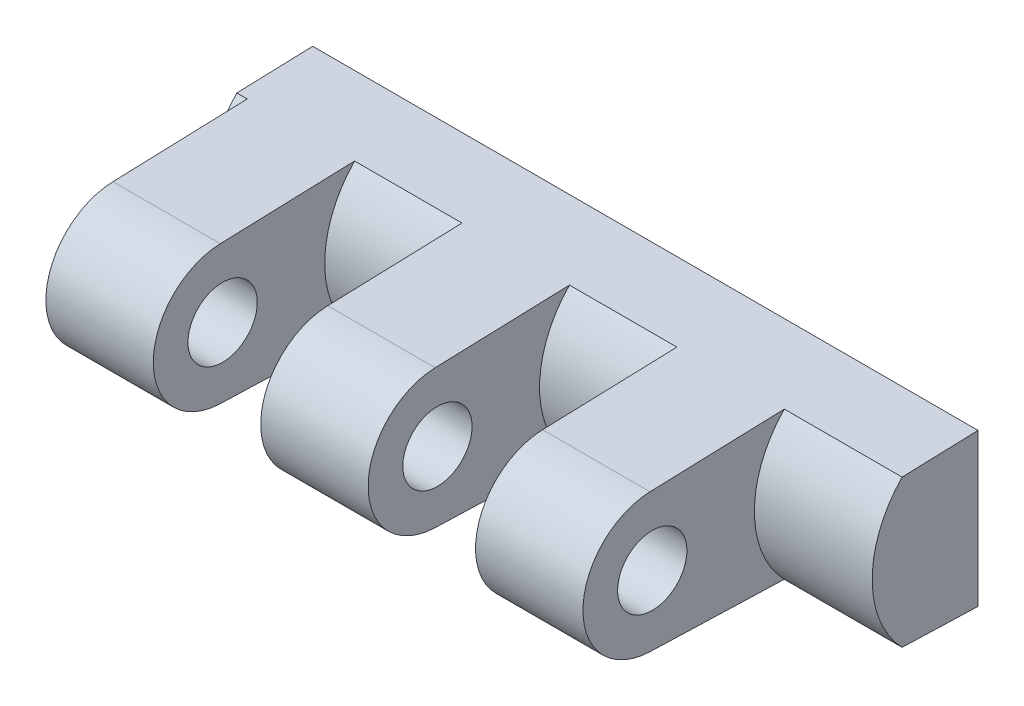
ISO-10303-21;
HEADER;
FILE_DESCRIPTION(('STEP AP214'),'2;1');
FILE_NAME('part.step','',(''),(''),'','','');
FILE_SCHEMA(('AUTOMOTIVE_DESIGN { 1 0 10303 214 1 1 1 1 }'));
ENDSEC;
DATA;
#1=APPLICATION_CONTEXT('core data for automotive mechanical design processes');
#2=APPLICATION_PROTOCOL_DEFINITION('international standard','automotive_design',2000,#1);
#3=PRODUCT_CONTEXT('',#1,'mechanical');
#4=PRODUCT('Part','Part','',(#3));
#5=PRODUCT_RELATED_PRODUCT_CATEGORY('part','',(#4));
#6=PRODUCT_DEFINITION_FORMATION('','',#4);
#7=PRODUCT_DEFINITION_CONTEXT('part definition',#1,'design');
#8=PRODUCT_DEFINITION('design','',#6,#7);
#9=PRODUCT_DEFINITION_SHAPE('','',#8);
#10=(LENGTH_UNIT() NAMED_UNIT(*) SI_UNIT(.MILLI.,.METRE.));
#11=(NAMED_UNIT(*) PLANE_ANGLE_UNIT() SI_UNIT($,.RADIAN.));
#12=(NAMED_UNIT(*) SI_UNIT($,.STERADIAN.) SOLID_ANGLE_UNIT());
#13=UNCERTAINTY_MEASURE_WITH_UNIT(LENGTH_MEASURE(1.E-05),#10,'distance_accuracy_value','');
#14=(GEOMETRIC_REPRESENTATION_CONTEXT(3) GLOBAL_UNCERTAINTY_ASSIGNED_CONTEXT((#13)) GLOBAL_UNIT_ASSIGNED_CONTEXT((#10,
#11,#12)) REPRESENTATION_CONTEXT('',''));
#15=CARTESIAN_POINT('',(0.,0.,0.));
#16=DIRECTION('',(0.,0.,1.));
#17=DIRECTION('',(1.,0.,0.));
#18=AXIS2_PLACEMENT_3D('',#15,#16,#17);
#19=CARTESIAN_POINT('',(36.25,-5.5,0.));
#20=DIRECTION('',(0.,-0.999450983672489,0.0331320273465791));
#21=DIRECTION('',(0.,0.0331320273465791,0.999450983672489));
#22=AXIS2_PLACEMENT_3D('',#19,#20,#21);
#23=PLANE('',#22);
#24=DIRECTION('',(-1.,0.,0.));
#25=VECTOR('',#24,1.);
#26=CARTESIAN_POINT('',(-11.755,-5.31847257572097,5.47590284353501));
#27=LINE('',#26,#25);
#28=CARTESIAN_POINT('',(-11.25,-5.31847257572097,5.47590284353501));
#29=VERTEX_POINT('',#28);
#30=CARTESIAN_POINT('',(-12.,-5.31847257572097,5.47590284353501));
#31=VERTEX_POINT('',#30);
#32=EDGE_CURVE('E135',#29,#31,#27,.T.);
#33=ORIENTED_EDGE('',*,*,#32,.T.);
#34=DIRECTION('',(0.,0.0331320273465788,0.999450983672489));
#35=VECTOR('',#34,1.);
#36=CARTESIAN_POINT('',(-12.,-5.5,0.));
#37=LINE('',#36,#35);
#38=CARTESIAN_POINT('',(-12.,-5.5,0.));
#39=VERTEX_POINT('',#38);
#40=EDGE_CURVE('E30',#39,#31,#37,.T.);
#41=ORIENTED_EDGE('',*,*,#40,.F.);
#42=DIRECTION('',(-1.,0.,0.));
#43=VECTOR('',#42,1.);
#44=CARTESIAN_POINT('',(36.25,-5.5,0.));
#45=LINE('',#44,#43);
#46=CARTESIAN_POINT('',(36.,-5.5,0.));
#47=VERTEX_POINT('',#46);
#48=EDGE_CURVE('E18',#39,#47,#45,.F.);
#49=ORIENTED_EDGE('',*,*,#48,.T.);
#50=DIRECTION('',(0.,-0.0331320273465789,-0.999450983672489));
#51=VECTOR('',#50,1.);
#52=CARTESIAN_POINT('',(36.,-5.31847257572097,5.47590284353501));
#53=LINE('',#52,#51);
#54=CARTESIAN_POINT('',(36.,-5.31847257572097,5.47590284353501));
#55=VERTEX_POINT('',#54);
#56=EDGE_CURVE('E281',#55,#47,#53,.T.);
#57=ORIENTED_EDGE('',*,*,#56,.F.);
#58=DIRECTION('',(1.,0.,0.));
#59=VECTOR('',#58,1.);
#60=CARTESIAN_POINT('',(36.25,-5.31847257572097,5.47590284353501));
#61=LINE('',#60,#59);
#62=CARTESIAN_POINT('',(27.5,-5.31847257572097,5.47590284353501));
#63=VERTEX_POINT('',#62);
#64=EDGE_CURVE('E181',#63,#55,#61,.T.);
#65=ORIENTED_EDGE('',*,*,#64,.F.);
#66=DIRECTION('',(0.,0.0331320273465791,0.999450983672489));
#67=VECTOR('',#66,1.);
#68=CARTESIAN_POINT('',(27.5,-5.5,0.));
#69=LINE('',#68,#67);
#70=CARTESIAN_POINT('',(27.5,-4.99725491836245,15.1656601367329));
#71=VERTEX_POINT('',#70);
#72=EDGE_CURVE('E189',#71,#63,#69,.F.);
#73=ORIENTED_EDGE('',*,*,#72,.F.);
#74=DIRECTION('',(1.,0.,0.));
#75=VECTOR('',#74,1.);
#76=CARTESIAN_POINT('',(36.25,-4.99725491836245,15.1656601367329));
#77=LINE('',#76,#75);
#78=CARTESIAN_POINT('',(19.75,-4.99725491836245,15.1656601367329));
#79=VERTEX_POINT('',#78);
#80=EDGE_CURVE('E187',#79,#71,#77,.T.);
#81=ORIENTED_EDGE('',*,*,#80,.F.);
#82=DIRECTION('',(0.,0.0331320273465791,0.999450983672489));
#83=VECTOR('',#82,1.);
#84=CARTESIAN_POINT('',(19.75,-5.5,0.));
#85=LINE('',#84,#83);
#86=CARTESIAN_POINT('',(19.75,-5.31847257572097,5.47590284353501));
#87=VERTEX_POINT('',#86);
#88=EDGE_CURVE('E190',#87,#79,#85,.T.);
#89=ORIENTED_EDGE('',*,*,#88,.F.);
#90=DIRECTION('',(1.,0.,0.));
#91=VECTOR('',#90,1.);
#92=CARTESIAN_POINT('',(36.25,-5.31847257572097,5.47590284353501));
#93=LINE('',#92,#91);
#94=CARTESIAN_POINT('',(12.,-5.31847257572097,5.47590284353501));
#95=VERTEX_POINT('',#94);
#96=EDGE_CURVE('E193',#95,#87,#93,.T.);
#97=ORIENTED_EDGE('',*,*,#96,.F.);
#98=DIRECTION('',(0.,0.0331320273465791,0.999450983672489));
#99=VECTOR('',#98,1.);
#100=CARTESIAN_POINT('',(12.,-5.5,0.));
#101=LINE('',#100,#99);
#102=CARTESIAN_POINT('',(12.,-4.99725491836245,15.1656601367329));
#103=VERTEX_POINT('',#102);
#104=EDGE_CURVE('E195',#103,#95,#101,.F.);
#105=ORIENTED_EDGE('',*,*,#104,.F.);
#106=DIRECTION('',(1.,0.,0.));
#107=VECTOR('',#106,1.);
#108=CARTESIAN_POINT('',(36.25,-4.99725491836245,15.1656601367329));
#109=LINE('',#108,#107);
#110=CARTESIAN_POINT('',(4.25,-4.99725491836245,15.1656601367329));
#111=VERTEX_POINT('',#110);
#112=EDGE_CURVE('E197',#111,#103,#109,.T.);
#113=ORIENTED_EDGE('',*,*,#112,.F.);
#114=DIRECTION('',(0.,0.0331320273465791,0.999450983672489));
#115=VECTOR('',#114,1.);
#116=CARTESIAN_POINT('',(4.25,-5.5,0.));
#117=LINE('',#116,#115);
#118=CARTESIAN_POINT('',(4.25,-5.31847257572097,5.47590284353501));
#119=VERTEX_POINT('',#118);
#120=EDGE_CURVE('E199',#119,#111,#117,.T.);
#121=ORIENTED_EDGE('',*,*,#120,.F.);
#122=DIRECTION('',(1.,0.,0.));
#123=VECTOR('',#122,1.);
#124=CARTESIAN_POINT('',(36.25,-5.31847257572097,5.47590284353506));
#125=LINE('',#124,#123);
#126=CARTESIAN_POINT('',(-3.5,-5.31847257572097,5.47590284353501));
#127=VERTEX_POINT('',#126);
#128=EDGE_CURVE('E201',#127,#119,#125,.T.);
#129=ORIENTED_EDGE('',*,*,#128,.F.);
#130=DIRECTION('',(0.,0.0331320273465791,0.999450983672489));
#131=VECTOR('',#130,1.);
#132=CARTESIAN_POINT('',(-3.5,-5.5,0.));
#133=LINE('',#132,#131);
#134=CARTESIAN_POINT('',(-3.5,-4.99725491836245,15.1656601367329));
#135=VERTEX_POINT('',#134);
#136=EDGE_CURVE('E203',#135,#127,#133,.F.);
#137=ORIENTED_EDGE('',*,*,#136,.F.);
#138=DIRECTION('',(1.,0.,0.));
#139=VECTOR('',#138,1.);
#140=CARTESIAN_POINT('',(36.25,-4.99725491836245,15.1656601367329));
#141=LINE('',#140,#139);
#142=CARTESIAN_POINT('',(-11.25,-4.99725491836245,15.1656601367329));
#143=VERTEX_POINT('',#142);
#144=EDGE_CURVE('E205',#143,#135,#141,.T.);
#145=ORIENTED_EDGE('',*,*,#144,.F.);
#146=DIRECTION('',(0.,0.0331320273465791,0.999450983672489));
#147=VECTOR('',#146,1.);
#148=CARTESIAN_POINT('',(-11.25,-5.5,0.));
#149=LINE('',#148,#147);
#150=EDGE_CURVE('E183',#29,#143,#149,.T.);
#151=ORIENTED_EDGE('',*,*,#150,.F.);
#152=EDGE_LOOP('',(#33,#41,#49,#57,#65,#73,#81,#89,#97,#105,#113,#121,#129,#137,#145,#151));
#153=FACE_BOUND('',#152,.T.);
#154=ADVANCED_FACE('F14',(#153),#23,.T.);
#155=CARTESIAN_POINT('',(36.25,4.99725491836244,15.1656601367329));
#156=DIRECTION('',(0.,0.999450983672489,0.0331320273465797));
#157=DIRECTION('',(0.,0.0331320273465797,-0.999450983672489));
#158=AXIS2_PLACEMENT_3D('',#155,#156,#157);
#159=PLANE('',#158);
#160=DIRECTION('',(-1.,0.,0.));
#161=VECTOR('',#160,1.);
#162=CARTESIAN_POINT('',(36.25,5.5,0.));
#163=LINE('',#162,#161);
#164=CARTESIAN_POINT('',(36.,5.5,0.));
#165=VERTEX_POINT('',#164);
#166=CARTESIAN_POINT('',(-12.,5.5,0.));
#167=VERTEX_POINT('',#166);
#168=EDGE_CURVE('E9',#165,#167,#163,.T.);
#169=ORIENTED_EDGE('',*,*,#168,.T.);
#170=DIRECTION('',(0.,0.0331320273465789,-0.999450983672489));
#171=VECTOR('',#170,1.);
#172=CARTESIAN_POINT('',(-12.,5.31847257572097,5.47590284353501));
#173=LINE('',#172,#171);
#174=CARTESIAN_POINT('',(-12.,5.31847257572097,5.47590284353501));
#175=VERTEX_POINT('',#174);
#176=EDGE_CURVE('E129',#175,#167,#173,.T.);
#177=ORIENTED_EDGE('',*,*,#176,.F.);
#178=DIRECTION('',(-1.,0.,0.));
#179=VECTOR('',#178,1.);
#180=CARTESIAN_POINT('',(-11.755,5.31847257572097,5.47590284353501));
#181=LINE('',#180,#179);
#182=CARTESIAN_POINT('',(-11.25,5.31847257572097,5.47590284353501));
#183=VERTEX_POINT('',#182);
#184=EDGE_CURVE('E210',#175,#183,#181,.F.);
#185=ORIENTED_EDGE('',*,*,#184,.T.);
#186=DIRECTION('',(0.,0.0331320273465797,-0.999450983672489));
#187=VECTOR('',#186,1.);
#188=CARTESIAN_POINT('',(-11.25,4.99725491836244,15.1656601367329));
#189=LINE('',#188,#187);
#190=CARTESIAN_POINT('',(-11.25,4.99725491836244,15.1656601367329));
#191=VERTEX_POINT('',#190);
#192=EDGE_CURVE('E141',#191,#183,#189,.T.);
#193=ORIENTED_EDGE('',*,*,#192,.F.);
#194=DIRECTION('',(1.,0.,0.));
#195=VECTOR('',#194,1.);
#196=CARTESIAN_POINT('',(36.25,4.99725491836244,15.1656601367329));
#197=LINE('',#196,#195);
#198=CARTESIAN_POINT('',(-3.5,4.99725491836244,15.1656601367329));
#199=VERTEX_POINT('',#198);
#200=EDGE_CURVE('E143',#199,#191,#197,.F.);
#201=ORIENTED_EDGE('',*,*,#200,.F.);
#202=DIRECTION('',(0.,0.0331320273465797,-0.999450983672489));
#203=VECTOR('',#202,1.);
#204=CARTESIAN_POINT('',(-3.5,4.99725491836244,15.1656601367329));
#205=LINE('',#204,#203);
#206=CARTESIAN_POINT('',(-3.5,5.31847257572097,5.47590284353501));
#207=VERTEX_POINT('',#206);
#208=EDGE_CURVE('E150',#207,#199,#205,.F.);
#209=ORIENTED_EDGE('',*,*,#208,.F.);
#210=DIRECTION('',(1.,0.,0.));
#211=VECTOR('',#210,1.);
#212=CARTESIAN_POINT('',(36.25,5.31847257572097,5.47590284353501));
#213=LINE('',#212,#211);
#214=CARTESIAN_POINT('',(4.25,5.31847257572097,5.47590284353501));
#215=VERTEX_POINT('',#214);
#216=EDGE_CURVE('E156',#215,#207,#213,.F.);
#217=ORIENTED_EDGE('',*,*,#216,.F.);
#218=DIRECTION('',(0.,0.0331320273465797,-0.999450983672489));
#219=VECTOR('',#218,1.);
#220=CARTESIAN_POINT('',(4.25,4.99725491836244,15.1656601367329));
#221=LINE('',#220,#219);
#222=CARTESIAN_POINT('',(4.25,4.99725491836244,15.1656601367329));
#223=VERTEX_POINT('',#222);
#224=EDGE_CURVE('E159',#223,#215,#221,.T.);
#225=ORIENTED_EDGE('',*,*,#224,.F.);
#226=DIRECTION('',(1.,0.,0.));
#227=VECTOR('',#226,1.);
#228=CARTESIAN_POINT('',(36.25,4.99725491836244,15.1656601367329));
#229=LINE('',#228,#227);
#230=CARTESIAN_POINT('',(12.,4.99725491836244,15.1656601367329));
#231=VERTEX_POINT('',#230);
#232=EDGE_CURVE('E162',#231,#223,#229,.F.);
#233=ORIENTED_EDGE('',*,*,#232,.F.);
#234=DIRECTION('',(0.,0.0331320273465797,-0.999450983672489));
#235=VECTOR('',#234,1.);
#236=CARTESIAN_POINT('',(12.,4.99725491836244,15.1656601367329));
#237=LINE('',#236,#235);
#238=CARTESIAN_POINT('',(12.,5.31847257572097,5.47590284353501));
#239=VERTEX_POINT('',#238);
#240=EDGE_CURVE('E165',#239,#231,#237,.F.);
#241=ORIENTED_EDGE('',*,*,#240,.F.);
#242=DIRECTION('',(1.,0.,0.));
#243=VECTOR('',#242,1.);
#244=CARTESIAN_POINT('',(36.25,5.31847257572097,5.47590284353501));
#245=LINE('',#244,#243);
#246=CARTESIAN_POINT('',(19.75,5.31847257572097,5.47590284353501));
#247=VERTEX_POINT('',#246);
#248=EDGE_CURVE('E168',#247,#239,#245,.F.);
#249=ORIENTED_EDGE('',*,*,#248,.F.);
#250=DIRECTION('',(0.,0.0331320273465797,-0.999450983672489));
#251=VECTOR('',#250,1.);
#252=CARTESIAN_POINT('',(19.75,4.99725491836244,15.1656601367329));
#253=LINE('',#252,#251);
#254=CARTESIAN_POINT('',(19.75,4.99725491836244,15.1656601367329));
#255=VERTEX_POINT('',#254);
#256=EDGE_CURVE('E171',#255,#247,#253,.T.);
#257=ORIENTED_EDGE('',*,*,#256,.F.);
#258=DIRECTION('',(1.,0.,0.));
#259=VECTOR('',#258,1.);
#260=CARTESIAN_POINT('',(36.25,4.99725491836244,15.1656601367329));
#261=LINE('',#260,#259);
#262=CARTESIAN_POINT('',(27.5,4.99725491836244,15.1656601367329));
#263=VERTEX_POINT('',#262);
#264=EDGE_CURVE('E174',#263,#255,#261,.F.);
#265=ORIENTED_EDGE('',*,*,#264,.F.);
#266=DIRECTION('',(0.,0.0331320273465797,-0.999450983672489));
#267=VECTOR('',#266,1.);
#268=CARTESIAN_POINT('',(27.5,4.99725491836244,15.1656601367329));
#269=LINE('',#268,#267);
#270=CARTESIAN_POINT('',(27.5,5.31847257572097,5.47590284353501));
#271=VERTEX_POINT('',#270);
#272=EDGE_CURVE('E177',#271,#263,#269,.F.);
#273=ORIENTED_EDGE('',*,*,#272,.F.);
#274=DIRECTION('',(1.,0.,0.));
#275=VECTOR('',#274,1.);
#276=CARTESIAN_POINT('',(36.25,5.31847257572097,5.47590284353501));
#277=LINE('',#276,#275);
#278=CARTESIAN_POINT('',(36.,5.31847257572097,5.47590284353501));
#279=VERTEX_POINT('',#278);
#280=EDGE_CURVE('E180',#279,#271,#277,.F.);
#281=ORIENTED_EDGE('',*,*,#280,.F.);
#282=DIRECTION('',(0.,-0.0331320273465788,0.999450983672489));
#283=VECTOR('',#282,1.);
#284=CARTESIAN_POINT('',(36.,5.5,0.));
#285=LINE('',#284,#283);
#286=EDGE_CURVE('E278',#165,#279,#285,.T.);
#287=ORIENTED_EDGE('',*,*,#286,.F.);
#288=EDGE_LOOP('',(#169,#177,#185,#193,#201,#209,#217,#225,#233,#241,#249,#257,#265,#273,#281,#287));
#289=FACE_BOUND('',#288,.T.);
#290=ADVANCED_FACE('F287',(#289),#159,.T.);
#291=CARTESIAN_POINT('',(36.25,5.5,0.));
#292=DIRECTION('',(0.,0.,-1.));
#293=DIRECTION('',(-1.,0.,0.));
#294=AXIS2_PLACEMENT_3D('',#291,#292,#293);
#295=PLANE('',#294);
#296=CARTESIAN_POINT('',(24.,0.,0.));
#297=DIRECTION('',(0.,0.,1.));
#298=DIRECTION('',(-1.,0.,0.));
#299=AXIS2_PLACEMENT_3D('',#296,#297,#298);
#300=CIRCLE('',#299,2.5);
#301=CARTESIAN_POINT('',(21.5,0.,0.));
#302=VERTEX_POINT('',#301);
#303=EDGE_CURVE('E265',#302,#302,#300,.T.);
#304=ORIENTED_EDGE('',*,*,#303,.T.);
#305=EDGE_LOOP('',(#304));
#306=FACE_BOUND('',#305,.T.);
#307=CARTESIAN_POINT('',(0.,0.,0.));
#308=DIRECTION('',(0.,0.,1.));
#309=DIRECTION('',(-1.,0.,0.));
#310=AXIS2_PLACEMENT_3D('',#307,#308,#309);
#311=CIRCLE('',#310,2.5);
#312=CARTESIAN_POINT('',(-2.5,0.,0.));
#313=VERTEX_POINT('',#312);
#314=EDGE_CURVE('E271',#313,#313,#311,.T.);
#315=ORIENTED_EDGE('',*,*,#314,.T.);
#316=EDGE_LOOP('',(#315));
#317=FACE_BOUND('',#316,.T.);
#318=ORIENTED_EDGE('',*,*,#48,.F.);
#319=DIRECTION('',(0.,-1.,0.));
#320=VECTOR('',#319,1.);
#321=CARTESIAN_POINT('',(-12.,5.5,0.));
#322=LINE('',#321,#320);
#323=EDGE_CURVE('E126',#167,#39,#322,.T.);
#324=ORIENTED_EDGE('',*,*,#323,.F.);
#325=ORIENTED_EDGE('',*,*,#168,.F.);
#326=DIRECTION('',(0.,1.,0.));
#327=VECTOR('',#326,1.);
#328=CARTESIAN_POINT('',(36.,-5.5,0.));
#329=LINE('',#328,#327);
#330=EDGE_CURVE('E140',#47,#165,#329,.T.);
#331=ORIENTED_EDGE('',*,*,#330,.F.);
#332=EDGE_LOOP('',(#318,#324,#325,#331));
#333=FACE_BOUND('',#332,.T.);
#334=ADVANCED_FACE('F139',(#306,#317,#333),#295,.T.);
#335=CARTESIAN_POINT('',(-11.755,0.,0.));
#336=DIRECTION('',(-1.,0.,0.));
#337=DIRECTION('',(0.,1.,0.));
#338=AXIS2_PLACEMENT_3D('',#335,#336,#337);
#339=CYLINDRICAL_SURFACE('',#338,7.63358778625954);
#340=ORIENTED_EDGE('',*,*,#184,.F.);
#341=CARTESIAN_POINT('',(-12.,0.,0.));
#342=DIRECTION('',(-1.,0.,0.));
#343=DIRECTION('',(0.,0.,1.));
#344=AXIS2_PLACEMENT_3D('',#341,#342,#343);
#345=CIRCLE('',#344,7.63358778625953);
#346=EDGE_CURVE('E136',#31,#175,#345,.T.);
#347=ORIENTED_EDGE('',*,*,#346,.F.);
#348=ORIENTED_EDGE('',*,*,#32,.F.);
#349=CARTESIAN_POINT('',(-11.25,0.,0.));
#350=DIRECTION('',(1.,0.,0.));
#351=DIRECTION('',(0.,1.,0.));
#352=AXIS2_PLACEMENT_3D('',#349,#350,#351);
#353=CIRCLE('',#352,7.63358778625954);
#354=EDGE_CURVE('E214',#183,#29,#353,.T.);
#355=ORIENTED_EDGE('',*,*,#354,.F.);
#356=EDGE_LOOP('',(#340,#347,#348,#355));
#357=FACE_BOUND('',#356,.T.);
#358=ADVANCED_FACE('F289',(#357),#339,.T.);
#359=CARTESIAN_POINT('',(31.88,0.,0.));
#360=DIRECTION('',(-1.,0.,0.));
#361=DIRECTION('',(0.,1.,0.));
#362=AXIS2_PLACEMENT_3D('',#359,#360,#361);
#363=CYLINDRICAL_SURFACE('',#362,7.63358778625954);
#364=ORIENTED_EDGE('',*,*,#64,.T.);
#365=CARTESIAN_POINT('',(36.,0.,0.));
#366=DIRECTION('',(1.,0.,0.));
#367=DIRECTION('',(0.,0.,-1.));
#368=AXIS2_PLACEMENT_3D('',#365,#366,#367);
#369=CIRCLE('',#368,7.63358778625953);
#370=EDGE_CURVE('E274',#279,#55,#369,.T.);
#371=ORIENTED_EDGE('',*,*,#370,.F.);
#372=ORIENTED_EDGE('',*,*,#280,.T.);
#373=CARTESIAN_POINT('',(27.5,0.,0.));
#374=DIRECTION('',(1.,0.,0.));
#375=DIRECTION('',(0.,1.,0.));
#376=AXIS2_PLACEMENT_3D('',#373,#374,#375);
#377=CIRCLE('',#376,7.63358778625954);
#378=EDGE_CURVE('E258',#63,#271,#377,.F.);
#379=ORIENTED_EDGE('',*,*,#378,.F.);
#380=EDGE_LOOP('',(#364,#371,#372,#379));
#381=FACE_BOUND('',#380,.T.);
#382=ADVANCED_FACE('F342',(#381),#363,.T.);
#383=CARTESIAN_POINT('',(36.25,0.,15.));
#384=DIRECTION('',(1.,0.,0.));
#385=DIRECTION('',(0.,-1.,0.));
#386=AXIS2_PLACEMENT_3D('',#383,#384,#385);
#387=CYLINDRICAL_SURFACE('',#386,2.5);
#388=CARTESIAN_POINT('',(19.75,0.,15.));
#389=DIRECTION('',(-1.,0.,0.));
#390=DIRECTION('',(0.,-1.,0.));
#391=AXIS2_PLACEMENT_3D('',#388,#389,#390);
#392=CIRCLE('',#391,2.5);
#393=CARTESIAN_POINT('',(19.75,-2.5,15.));
#394=VERTEX_POINT('',#393);
#395=EDGE_CURVE('E252',#394,#394,#392,.F.);
#396=ORIENTED_EDGE('',*,*,#395,.F.);
#397=EDGE_LOOP('',(#396));
#398=FACE_BOUND('',#397,.T.);
#399=CARTESIAN_POINT('',(27.5,0.,15.));
#400=DIRECTION('',(-1.,0.,0.));
#401=DIRECTION('',(0.,-1.,0.));
#402=AXIS2_PLACEMENT_3D('',#399,#400,#401);
#403=CIRCLE('',#402,2.5);
#404=CARTESIAN_POINT('',(27.5,-2.5,15.));
#405=VERTEX_POINT('',#404);
#406=EDGE_CURVE('E209',#405,#405,#403,.T.);
#407=ORIENTED_EDGE('',*,*,#406,.F.);
#408=EDGE_LOOP('',(#407));
#409=FACE_BOUND('',#408,.T.);
#410=ADVANCED_FACE('F393',(#398,#409),#387,.F.);
#411=CARTESIAN_POINT('',(36.25,0.,15.));
#412=DIRECTION('',(1.,0.,0.));
#413=DIRECTION('',(0.,-1.,0.));
#414=AXIS2_PLACEMENT_3D('',#411,#412,#413);
#415=CYLINDRICAL_SURFACE('',#414,2.5);
#416=CARTESIAN_POINT('',(4.25,0.,15.));
#417=DIRECTION('',(-1.,0.,0.));
#418=DIRECTION('',(0.,-1.,0.));
#419=AXIS2_PLACEMENT_3D('',#416,#417,#418);
#420=CIRCLE('',#419,2.5);
#421=CARTESIAN_POINT('',(4.25,-2.5,15.));
#422=VERTEX_POINT('',#421);
#423=EDGE_CURVE('E234',#422,#422,#420,.F.);
#424=ORIENTED_EDGE('',*,*,#423,.F.);
#425=EDGE_LOOP('',(#424));
#426=FACE_BOUND('',#425,.T.);
#427=CARTESIAN_POINT('',(12.,0.,15.));
#428=DIRECTION('',(-1.,0.,0.));
#429=DIRECTION('',(0.,-1.,0.));
#430=AXIS2_PLACEMENT_3D('',#427,#428,#429);
#431=CIRCLE('',#430,2.5);
#432=CARTESIAN_POINT('',(12.,-2.5,15.));
#433=VERTEX_POINT('',#432);
#434=EDGE_CURVE('E243',#433,#433,#431,.T.);
#435=ORIENTED_EDGE('',*,*,#434,.F.);
#436=EDGE_LOOP('',(#435));
#437=FACE_BOUND('',#436,.T.);
#438=ADVANCED_FACE('F398',(#426,#437),#415,.F.);
#439=CARTESIAN_POINT('',(36.25,0.,15.));
#440=DIRECTION('',(1.,0.,0.));
#441=DIRECTION('',(0.,-1.,0.));
#442=AXIS2_PLACEMENT_3D('',#439,#440,#441);
#443=CYLINDRICAL_SURFACE('',#442,2.5);
#444=CARTESIAN_POINT('',(-11.25,0.,15.));
#445=DIRECTION('',(-1.,0.,0.));
#446=DIRECTION('',(0.,-1.,0.));
#447=AXIS2_PLACEMENT_3D('',#444,#445,#446);
#448=CIRCLE('',#447,2.5);
#449=CARTESIAN_POINT('',(-11.25,-2.5,15.));
#450=VERTEX_POINT('',#449);
#451=EDGE_CURVE('E216',#450,#450,#448,.F.);
#452=ORIENTED_EDGE('',*,*,#451,.F.);
#453=EDGE_LOOP('',(#452));
#454=FACE_BOUND('',#453,.T.);
#455=CARTESIAN_POINT('',(-3.5,0.,15.));
#456=DIRECTION('',(-1.,0.,0.));
#457=DIRECTION('',(0.,-1.,0.));
#458=AXIS2_PLACEMENT_3D('',#455,#456,#457);
#459=CIRCLE('',#458,2.5);
#460=CARTESIAN_POINT('',(-3.5,-2.5,15.));
#461=VERTEX_POINT('',#460);
#462=EDGE_CURVE('E225',#461,#461,#459,.T.);
#463=ORIENTED_EDGE('',*,*,#462,.F.);
#464=EDGE_LOOP('',(#463));
#465=FACE_BOUND('',#464,.T.);
#466=ADVANCED_FACE('F390',(#454,#465),#443,.F.);
#467=CARTESIAN_POINT('',(27.5,-15.8167938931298,0.));
#468=DIRECTION('',(-1.,0.,0.));
#469=DIRECTION('',(0.,1.,0.));
#470=AXIS2_PLACEMENT_3D('',#467,#468,#469);
#471=PLANE('',#470);
#472=ORIENTED_EDGE('',*,*,#378,.T.);
#473=ORIENTED_EDGE('',*,*,#272,.T.);
#474=CARTESIAN_POINT('',(27.5,0.,15.));
#475=DIRECTION('',(-1.,0.,0.));
#476=DIRECTION('',(0.,-1.,0.));
#477=AXIS2_PLACEMENT_3D('',#474,#475,#476);
#478=CIRCLE('',#477,5.);
#479=EDGE_CURVE('E255',#263,#71,#478,.F.);
#480=ORIENTED_EDGE('',*,*,#479,.T.);
#481=ORIENTED_EDGE('',*,*,#72,.T.);
#482=EDGE_LOOP('',(#472,#473,#480,#481));
#483=FACE_BOUND('',#482,.T.);
#484=ORIENTED_EDGE('',*,*,#406,.T.);
#485=EDGE_LOOP('',(#484));
#486=FACE_BOUND('',#485,.T.);
#487=ADVANCED_FACE('F338',(#483,#486),#471,.F.);
#488=CARTESIAN_POINT('',(36.25,0.,15.));
#489=DIRECTION('',(1.,0.,0.));
#490=DIRECTION('',(0.,-1.,0.));
#491=AXIS2_PLACEMENT_3D('',#488,#489,#490);
#492=CYLINDRICAL_SURFACE('',#491,5.);
#493=CARTESIAN_POINT('',(19.75,0.,15.));
#494=DIRECTION('',(-1.,0.,0.));
#495=DIRECTION('',(0.,-1.,0.));
#496=AXIS2_PLACEMENT_3D('',#493,#494,#495);
#497=CIRCLE('',#496,5.);
#498=EDGE_CURVE('E249',#79,#255,#497,.T.);
#499=ORIENTED_EDGE('',*,*,#498,.F.);
#500=ORIENTED_EDGE('',*,*,#80,.T.);
#501=ORIENTED_EDGE('',*,*,#479,.F.);
#502=ORIENTED_EDGE('',*,*,#264,.T.);
#503=EDGE_LOOP('',(#499,#500,#501,#502));
#504=FACE_BOUND('',#503,.T.);
#505=ADVANCED_FACE('F331',(#504),#492,.T.);
#506=CARTESIAN_POINT('',(19.75,-15.8167938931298,0.));
#507=DIRECTION('',(1.,0.,0.));
#508=DIRECTION('',(0.,-1.,0.));
#509=AXIS2_PLACEMENT_3D('',#506,#507,#508);
#510=PLANE('',#509);
#511=ORIENTED_EDGE('',*,*,#498,.T.);
#512=ORIENTED_EDGE('',*,*,#256,.T.);
#513=CARTESIAN_POINT('',(19.75,0.,0.));
#514=DIRECTION('',(1.,0.,0.));
#515=DIRECTION('',(0.,1.,0.));
#516=AXIS2_PLACEMENT_3D('',#513,#514,#515);
#517=CIRCLE('',#516,7.63358778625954);
#518=EDGE_CURVE('E246',#247,#87,#517,.T.);
#519=ORIENTED_EDGE('',*,*,#518,.T.);
#520=ORIENTED_EDGE('',*,*,#88,.T.);
#521=EDGE_LOOP('',(#511,#512,#519,#520));
#522=FACE_BOUND('',#521,.T.);
#523=ORIENTED_EDGE('',*,*,#395,.T.);
#524=EDGE_LOOP('',(#523));
#525=FACE_BOUND('',#524,.T.);
#526=ADVANCED_FACE('F326',(#522,#525),#510,.F.);
#527=CARTESIAN_POINT('',(15.875,0.,0.));
#528=DIRECTION('',(-1.,0.,0.));
#529=DIRECTION('',(0.,1.,0.));
#530=AXIS2_PLACEMENT_3D('',#527,#528,#529);
#531=CYLINDRICAL_SURFACE('',#530,7.63358778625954);
#532=ORIENTED_EDGE('',*,*,#96,.T.);
#533=ORIENTED_EDGE('',*,*,#518,.F.);
#534=ORIENTED_EDGE('',*,*,#248,.T.);
#535=CARTESIAN_POINT('',(12.,0.,0.));
#536=DIRECTION('',(1.,0.,0.));
#537=DIRECTION('',(0.,1.,0.));
#538=AXIS2_PLACEMENT_3D('',#535,#536,#537);
#539=CIRCLE('',#538,7.63358778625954);
#540=EDGE_CURVE('E240',#95,#239,#539,.F.);
#541=ORIENTED_EDGE('',*,*,#540,.F.);
#542=EDGE_LOOP('',(#532,#533,#534,#541));
#543=FACE_BOUND('',#542,.T.);
#544=ADVANCED_FACE('F322',(#543),#531,.T.);
#545=CARTESIAN_POINT('',(12.,-15.8167938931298,0.));
#546=DIRECTION('',(-1.,0.,0.));
#547=DIRECTION('',(0.,1.,0.));
#548=AXIS2_PLACEMENT_3D('',#545,#546,#547);
#549=PLANE('',#548);
#550=ORIENTED_EDGE('',*,*,#540,.T.);
#551=ORIENTED_EDGE('',*,*,#240,.T.);
#552=CARTESIAN_POINT('',(12.,0.,15.));
#553=DIRECTION('',(-1.,0.,0.));
#554=DIRECTION('',(0.,-1.,0.));
#555=AXIS2_PLACEMENT_3D('',#552,#553,#554);
#556=CIRCLE('',#555,5.);
#557=EDGE_CURVE('E237',#231,#103,#556,.F.);
#558=ORIENTED_EDGE('',*,*,#557,.T.);
#559=ORIENTED_EDGE('',*,*,#104,.T.);
#560=EDGE_LOOP('',(#550,#551,#558,#559));
#561=FACE_BOUND('',#560,.T.);
#562=ORIENTED_EDGE('',*,*,#434,.T.);
#563=EDGE_LOOP('',(#562));
#564=FACE_BOUND('',#563,.T.);
#565=ADVANCED_FACE('F317',(#561,#564),#549,.F.);
#566=CARTESIAN_POINT('',(36.25,0.,15.));
#567=DIRECTION('',(1.,0.,0.));
#568=DIRECTION('',(0.,-1.,0.));
#569=AXIS2_PLACEMENT_3D('',#566,#567,#568);
#570=CYLINDRICAL_SURFACE('',#569,5.);
#571=CARTESIAN_POINT('',(4.25,0.,15.));
#572=DIRECTION('',(-1.,0.,0.));
#573=DIRECTION('',(0.,-1.,0.));
#574=AXIS2_PLACEMENT_3D('',#571,#572,#573);
#575=CIRCLE('',#574,5.);
#576=EDGE_CURVE('E231',#111,#223,#575,.T.);
#577=ORIENTED_EDGE('',*,*,#576,.F.);
#578=ORIENTED_EDGE('',*,*,#112,.T.);
#579=ORIENTED_EDGE('',*,*,#557,.F.);
#580=ORIENTED_EDGE('',*,*,#232,.T.);
#581=EDGE_LOOP('',(#577,#578,#579,#580));
#582=FACE_BOUND('',#581,.T.);
#583=ADVANCED_FACE('F313',(#582),#570,.T.);
#584=CARTESIAN_POINT('',(4.25,-15.8167938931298,0.));
#585=DIRECTION('',(1.,0.,0.));
#586=DIRECTION('',(0.,-1.,0.));
#587=AXIS2_PLACEMENT_3D('',#584,#585,#586);
#588=PLANE('',#587);
#589=ORIENTED_EDGE('',*,*,#576,.T.);
#590=ORIENTED_EDGE('',*,*,#224,.T.);
#591=CARTESIAN_POINT('',(4.25,0.,0.));
#592=DIRECTION('',(1.,0.,0.));
#593=DIRECTION('',(0.,1.,0.));
#594=AXIS2_PLACEMENT_3D('',#591,#592,#593);
#595=CIRCLE('',#594,7.63358778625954);
#596=EDGE_CURVE('E228',#215,#119,#595,.T.);
#597=ORIENTED_EDGE('',*,*,#596,.T.);
#598=ORIENTED_EDGE('',*,*,#120,.T.);
#599=EDGE_LOOP('',(#589,#590,#597,#598));
#600=FACE_BOUND('',#599,.T.);
#601=ORIENTED_EDGE('',*,*,#423,.T.);
#602=EDGE_LOOP('',(#601));
#603=FACE_BOUND('',#602,.T.);
#604=ADVANCED_FACE('F308',(#600,#603),#588,.F.);
#605=CARTESIAN_POINT('',(0.375,0.,0.));
#606=DIRECTION('',(-1.,0.,0.));
#607=DIRECTION('',(0.,1.,0.));
#608=AXIS2_PLACEMENT_3D('',#605,#606,#607);
#609=CYLINDRICAL_SURFACE('',#608,7.63358778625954);
#610=ORIENTED_EDGE('',*,*,#128,.T.);
#611=ORIENTED_EDGE('',*,*,#596,.F.);
#612=ORIENTED_EDGE('',*,*,#216,.T.);
#613=CARTESIAN_POINT('',(-3.5,0.,0.));
#614=DIRECTION('',(1.,0.,0.));
#615=DIRECTION('',(0.,1.,0.));
#616=AXIS2_PLACEMENT_3D('',#613,#614,#615);
#617=CIRCLE('',#616,7.63358778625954);
#618=EDGE_CURVE('E222',#127,#207,#617,.F.);
#619=ORIENTED_EDGE('',*,*,#618,.F.);
#620=EDGE_LOOP('',(#610,#611,#612,#619));
#621=FACE_BOUND('',#620,.T.);
#622=ADVANCED_FACE('F305',(#621),#609,.T.);
#623=CARTESIAN_POINT('',(-3.5,-15.8167938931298,0.));
#624=DIRECTION('',(-1.,0.,0.));
#625=DIRECTION('',(0.,1.,0.));
#626=AXIS2_PLACEMENT_3D('',#623,#624,#625);
#627=PLANE('',#626);
#628=ORIENTED_EDGE('',*,*,#618,.T.);
#629=ORIENTED_EDGE('',*,*,#208,.T.);
#630=CARTESIAN_POINT('',(-3.5,0.,15.));
#631=DIRECTION('',(-1.,0.,0.));
#632=DIRECTION('',(0.,-1.,0.));
#633=AXIS2_PLACEMENT_3D('',#630,#631,#632);
#634=CIRCLE('',#633,5.);
#635=EDGE_CURVE('E219',#199,#135,#634,.F.);
#636=ORIENTED_EDGE('',*,*,#635,.T.);
#637=ORIENTED_EDGE('',*,*,#136,.T.);
#638=EDGE_LOOP('',(#628,#629,#636,#637));
#639=FACE_BOUND('',#638,.T.);
#640=ORIENTED_EDGE('',*,*,#462,.T.);
#641=EDGE_LOOP('',(#640));
#642=FACE_BOUND('',#641,.T.);
#643=ADVANCED_FACE('F302',(#639,#642),#627,.F.);
#644=CARTESIAN_POINT('',(36.25,0.,15.));
#645=DIRECTION('',(1.,0.,0.));
#646=DIRECTION('',(0.,-1.,0.));
#647=AXIS2_PLACEMENT_3D('',#644,#645,#646);
#648=CYLINDRICAL_SURFACE('',#647,5.);
#649=CARTESIAN_POINT('',(-11.25,0.,15.));
#650=DIRECTION('',(-1.,0.,0.));
#651=DIRECTION('',(0.,-1.,0.));
#652=AXIS2_PLACEMENT_3D('',#649,#650,#651);
#653=CIRCLE('',#652,5.);
#654=EDGE_CURVE('E184',#143,#191,#653,.T.);
#655=ORIENTED_EDGE('',*,*,#654,.F.);
#656=ORIENTED_EDGE('',*,*,#144,.T.);
#657=ORIENTED_EDGE('',*,*,#635,.F.);
#658=ORIENTED_EDGE('',*,*,#200,.T.);
#659=EDGE_LOOP('',(#655,#656,#657,#658));
#660=FACE_BOUND('',#659,.T.);
#661=ADVANCED_FACE('F298',(#660),#648,.T.);
#662=CARTESIAN_POINT('',(-11.25,-15.8167938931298,0.));
#663=DIRECTION('',(1.,0.,0.));
#664=DIRECTION('',(0.,-1.,0.));
#665=AXIS2_PLACEMENT_3D('',#662,#663,#664);
#666=PLANE('',#665);
#667=ORIENTED_EDGE('',*,*,#654,.T.);
#668=ORIENTED_EDGE('',*,*,#192,.T.);
#669=ORIENTED_EDGE('',*,*,#354,.T.);
#670=ORIENTED_EDGE('',*,*,#150,.T.);
#671=EDGE_LOOP('',(#667,#668,#669,#670));
#672=FACE_BOUND('',#671,.T.);
#673=ORIENTED_EDGE('',*,*,#451,.T.);
#674=EDGE_LOOP('',(#673));
#675=FACE_BOUND('',#674,.T.);
#676=ADVANCED_FACE('F290',(#672,#675),#666,.F.);
#677=CARTESIAN_POINT('',(24.,0.,6.5));
#678=DIRECTION('',(0.,0.,-1.));
#679=DIRECTION('',(-1.,0.,0.));
#680=AXIS2_PLACEMENT_3D('',#677,#678,#679);
#681=CYLINDRICAL_SURFACE('',#680,2.5);
#682=CARTESIAN_POINT('',(24.,0.,6.5));
#683=DIRECTION('',(0.,0.,1.));
#684=DIRECTION('',(-1.,0.,0.));
#685=AXIS2_PLACEMENT_3D('',#682,#683,#684);
#686=CIRCLE('',#685,2.5);
#687=CARTESIAN_POINT('',(21.5,0.,6.5));
#688=VERTEX_POINT('',#687);
#689=EDGE_CURVE('E212',#688,#688,#686,.T.);
#690=ORIENTED_EDGE('',*,*,#689,.T.);
#691=EDGE_LOOP('',(#690));
#692=FACE_BOUND('',#691,.T.);
#693=ORIENTED_EDGE('',*,*,#303,.F.);
#694=EDGE_LOOP('',(#693));
#695=FACE_BOUND('',#694,.T.);
#696=ADVANCED_FACE('F369',(#692,#695),#681,.F.);
#697=CARTESIAN_POINT('',(22.9665,0.,6.5));
#698=DIRECTION('',(0.,0.,1.));
#699=DIRECTION('',(1.,0.,0.));
#700=AXIS2_PLACEMENT_3D('',#697,#698,#699);
#701=PLANE('',#700);
#702=ORIENTED_EDGE('',*,*,#689,.F.);
#703=EDGE_LOOP('',(#702));
#704=FACE_BOUND('',#703,.T.);
#705=ADVANCED_FACE('F405',(#704),#701,.F.);
#706=CARTESIAN_POINT('',(0.,0.,6.5));
#707=DIRECTION('',(0.,0.,-1.));
#708=DIRECTION('',(-1.,0.,0.));
#709=AXIS2_PLACEMENT_3D('',#706,#707,#708);
#710=CYLINDRICAL_SURFACE('',#709,2.5);
#711=CARTESIAN_POINT('',(0.,0.,6.5));
#712=DIRECTION('',(0.,0.,1.));
#713=DIRECTION('',(-1.,0.,0.));
#714=AXIS2_PLACEMENT_3D('',#711,#712,#713);
#715=CIRCLE('',#714,2.5);
#716=CARTESIAN_POINT('',(-2.5,0.,6.5));
#717=VERTEX_POINT('',#716);
#718=EDGE_CURVE('E268',#717,#717,#715,.T.);
#719=ORIENTED_EDGE('',*,*,#718,.T.);
#720=EDGE_LOOP('',(#719));
#721=FACE_BOUND('',#720,.T.);
#722=ORIENTED_EDGE('',*,*,#314,.F.);
#723=EDGE_LOOP('',(#722));
#724=FACE_BOUND('',#723,.T.);
#725=ADVANCED_FACE('F355',(#721,#724),#710,.F.);
#726=CARTESIAN_POINT('',(-1.0335,0.,6.5));
#727=DIRECTION('',(0.,0.,1.));
#728=DIRECTION('',(1.,0.,0.));
#729=AXIS2_PLACEMENT_3D('',#726,#727,#728);
#730=PLANE('',#729);
#731=ORIENTED_EDGE('',*,*,#718,.F.);
#732=EDGE_LOOP('',(#731));
#733=FACE_BOUND('',#732,.T.);
#734=ADVANCED_FACE('F16',(#733),#730,.F.);
#735=CARTESIAN_POINT('',(36.,0.,0.));
#736=DIRECTION('',(1.,0.,0.));
#737=DIRECTION('',(0.,0.,-1.));
#738=AXIS2_PLACEMENT_3D('',#735,#736,#737);
#739=PLANE('',#738);
#740=ORIENTED_EDGE('',*,*,#56,.T.);
#741=ORIENTED_EDGE('',*,*,#330,.T.);
#742=ORIENTED_EDGE('',*,*,#286,.T.);
#743=ORIENTED_EDGE('',*,*,#370,.T.);
#744=EDGE_LOOP('',(#740,#741,#742,#743));
#745=FACE_BOUND('',#744,.T.);
#746=ADVANCED_FACE('F345',(#745),#739,.T.);
#747=CARTESIAN_POINT('',(-12.,0.,0.));
#748=DIRECTION('',(-1.,0.,0.));
#749=DIRECTION('',(0.,0.,1.));
#750=AXIS2_PLACEMENT_3D('',#747,#748,#749);
#751=PLANE('',#750);
#752=ORIENTED_EDGE('',*,*,#323,.T.);
#753=ORIENTED_EDGE('',*,*,#40,.T.);
#754=ORIENTED_EDGE('',*,*,#346,.T.);
#755=ORIENTED_EDGE('',*,*,#176,.T.);
#756=EDGE_LOOP('',(#752,#753,#754,#755));
#757=FACE_BOUND('',#756,.T.);
#758=ADVANCED_FACE('F127',(#757),#751,.T.);
#759=CLOSED_SHELL('',(#154,#290,#334,#358,#382,#410,#438,#466,#487,#505,#526,#544,#565,#583,
#604,#622,#643,#661,#676,#696,#705,#725,#734,#746,#758));
#760=MANIFOLD_SOLID_BREP('B1',#759);
#761=ADVANCED_BREP_SHAPE_REPRESENTATION('',(#18,#760),#14);
#762=SHAPE_DEFINITION_REPRESENTATION(#9,#761);
ENDSEC;
END-ISO-10303-21;
